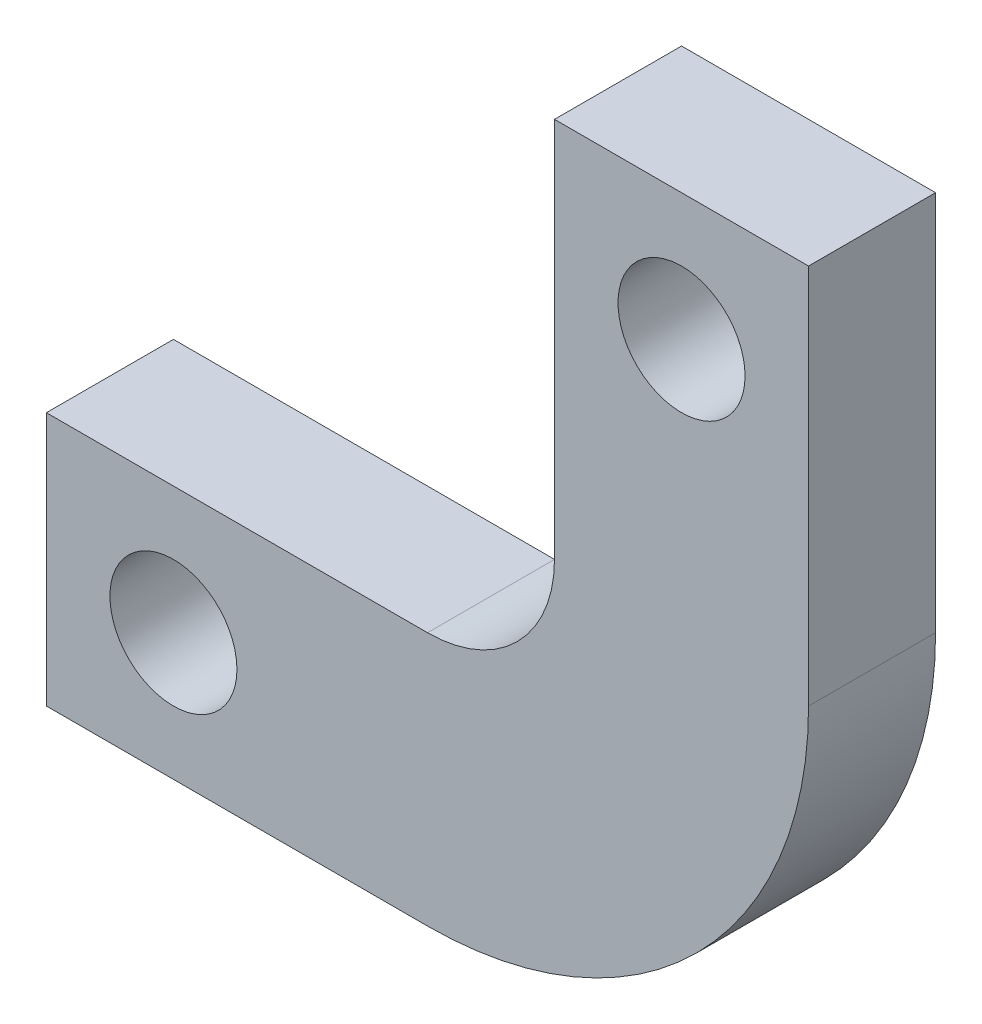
ISO-10303-21;
HEADER;
FILE_DESCRIPTION(('STEP AP214'),'2;1');
FILE_NAME('part.step','',(''),(''),'','','');
FILE_SCHEMA(('AUTOMOTIVE_DESIGN { 1 0 10303 214 1 1 1 1 }'));
ENDSEC;
DATA;
#1=APPLICATION_CONTEXT('core data for automotive mechanical design processes');
#2=APPLICATION_PROTOCOL_DEFINITION('international standard','automotive_design',2000,#1);
#3=PRODUCT_CONTEXT('',#1,'mechanical');
#4=PRODUCT('Part','Part','',(#3));
#5=PRODUCT_RELATED_PRODUCT_CATEGORY('part','',(#4));
#6=PRODUCT_DEFINITION_FORMATION('','',#4);
#7=PRODUCT_DEFINITION_CONTEXT('part definition',#1,'design');
#8=PRODUCT_DEFINITION('design','',#6,#7);
#9=PRODUCT_DEFINITION_SHAPE('','',#8);
#10=(LENGTH_UNIT() NAMED_UNIT(*) SI_UNIT(.MILLI.,.METRE.));
#11=(NAMED_UNIT(*) PLANE_ANGLE_UNIT() SI_UNIT($,.RADIAN.));
#12=(NAMED_UNIT(*) SI_UNIT($,.STERADIAN.) SOLID_ANGLE_UNIT());
#13=UNCERTAINTY_MEASURE_WITH_UNIT(LENGTH_MEASURE(1.E-05),#10,'distance_accuracy_value','');
#14=(GEOMETRIC_REPRESENTATION_CONTEXT(3) GLOBAL_UNCERTAINTY_ASSIGNED_CONTEXT((#13)) GLOBAL_UNIT_ASSIGNED_CONTEXT((#10,
#11,#12)) REPRESENTATION_CONTEXT('',''));
#15=CARTESIAN_POINT('',(0.,0.,0.));
#16=DIRECTION('',(0.,0.,1.));
#17=DIRECTION('',(1.,0.,0.));
#18=AXIS2_PLACEMENT_3D('',#15,#16,#17);
#19=CARTESIAN_POINT('',(18.,18.,3.));
#20=DIRECTION('',(0.,0.,1.));
#21=DIRECTION('',(1.,0.,0.));
#22=AXIS2_PLACEMENT_3D('',#19,#20,#21);
#23=PLANE('',#22);
#24=CARTESIAN_POINT('',(6.,6.,3.));
#25=DIRECTION('',(0.,0.,1.));
#26=DIRECTION('',(1.,0.,0.));
#27=AXIS2_PLACEMENT_3D('',#24,#25,#26);
#28=CIRCLE('',#27,3.);
#29=CARTESIAN_POINT('',(9.,6.,3.));
#30=VERTEX_POINT('',#29);
#31=EDGE_CURVE('E135',#30,#30,#28,.T.);
#32=ORIENTED_EDGE('',*,*,#31,.F.);
#33=EDGE_LOOP('',(#32));
#34=FACE_BOUND('',#33,.T.);
#35=DIRECTION('',(0.,-1.,0.));
#36=VECTOR('',#35,1.);
#37=CARTESIAN_POINT('',(0.,0.,3.));
#38=LINE('',#37,#36);
#39=CARTESIAN_POINT('',(0.,12.,3.));
#40=VERTEX_POINT('',#39);
#41=CARTESIAN_POINT('',(0.,0.,3.));
#42=VERTEX_POINT('',#41);
#43=EDGE_CURVE('E146',#40,#42,#38,.T.);
#44=ORIENTED_EDGE('',*,*,#43,.T.);
#45=DIRECTION('',(1.,0.,0.));
#46=VECTOR('',#45,1.);
#47=CARTESIAN_POINT('',(0.,0.,3.));
#48=LINE('',#47,#46);
#49=CARTESIAN_POINT('',(18.,0.,3.));
#50=VERTEX_POINT('',#49);
#51=EDGE_CURVE('E94',#42,#50,#48,.T.);
#52=ORIENTED_EDGE('',*,*,#51,.T.);
#53=CARTESIAN_POINT('',(18.,18.,3.));
#54=DIRECTION('',(0.,0.,1.));
#55=DIRECTION('',(1.,0.,0.));
#56=AXIS2_PLACEMENT_3D('',#53,#54,#55);
#57=CIRCLE('',#56,18.);
#58=CARTESIAN_POINT('',(36.,18.,3.));
#59=VERTEX_POINT('',#58);
#60=EDGE_CURVE('E161',#50,#59,#57,.T.);
#61=ORIENTED_EDGE('',*,*,#60,.T.);
#62=DIRECTION('',(0.,1.,0.));
#63=VECTOR('',#62,1.);
#64=CARTESIAN_POINT('',(36.,18.,3.));
#65=LINE('',#64,#63);
#66=CARTESIAN_POINT('',(36.,36.,3.));
#67=VERTEX_POINT('',#66);
#68=EDGE_CURVE('E174',#59,#67,#65,.T.);
#69=ORIENTED_EDGE('',*,*,#68,.T.);
#70=DIRECTION('',(-1.,0.,0.));
#71=VECTOR('',#70,1.);
#72=CARTESIAN_POINT('',(36.,36.,3.));
#73=LINE('',#72,#71);
#74=CARTESIAN_POINT('',(24.,36.,3.));
#75=VERTEX_POINT('',#74);
#76=EDGE_CURVE('E113',#67,#75,#73,.T.);
#77=ORIENTED_EDGE('',*,*,#76,.T.);
#78=DIRECTION('',(0.,-1.,0.));
#79=VECTOR('',#78,1.);
#80=CARTESIAN_POINT('',(24.,18.,3.));
#81=LINE('',#80,#79);
#82=CARTESIAN_POINT('',(24.,18.,3.));
#83=VERTEX_POINT('',#82);
#84=EDGE_CURVE('E107',#75,#83,#81,.T.);
#85=ORIENTED_EDGE('',*,*,#84,.T.);
#86=CARTESIAN_POINT('',(18.,18.,3.));
#87=DIRECTION('',(0.,0.,-1.));
#88=DIRECTION('',(1.,0.,0.));
#89=AXIS2_PLACEMENT_3D('',#86,#87,#88);
#90=CIRCLE('',#89,6.);
#91=CARTESIAN_POINT('',(18.,12.,3.));
#92=VERTEX_POINT('',#91);
#93=EDGE_CURVE('E111',#83,#92,#90,.T.);
#94=ORIENTED_EDGE('',*,*,#93,.T.);
#95=DIRECTION('',(-1.,0.,0.));
#96=VECTOR('',#95,1.);
#97=CARTESIAN_POINT('',(0.,12.,3.));
#98=LINE('',#97,#96);
#99=EDGE_CURVE('E51',#92,#40,#98,.T.);
#100=ORIENTED_EDGE('',*,*,#99,.T.);
#101=EDGE_LOOP('',(#44,#52,#61,#69,#77,#85,#94,#100));
#102=FACE_BOUND('',#101,.T.);
#103=CARTESIAN_POINT('',(30.,30.,3.));
#104=DIRECTION('',(0.,0.,1.));
#105=DIRECTION('',(1.,0.,0.));
#106=AXIS2_PLACEMENT_3D('',#103,#104,#105);
#107=CIRCLE('',#106,3.);
#108=CARTESIAN_POINT('',(33.,30.,3.));
#109=VERTEX_POINT('',#108);
#110=EDGE_CURVE('E183',#109,#109,#107,.T.);
#111=ORIENTED_EDGE('',*,*,#110,.F.);
#112=EDGE_LOOP('',(#111));
#113=FACE_BOUND('',#112,.T.);
#114=ADVANCED_FACE('F34',(#34,#102,#113),#23,.T.);
#115=CARTESIAN_POINT('',(18.,18.,-3.));
#116=DIRECTION('',(0.,0.,1.));
#117=DIRECTION('',(1.,0.,0.));
#118=AXIS2_PLACEMENT_3D('',#115,#116,#117);
#119=PLANE('',#118);
#120=DIRECTION('',(0.,-1.,0.));
#121=VECTOR('',#120,1.);
#122=CARTESIAN_POINT('',(0.,0.,-3.));
#123=LINE('',#122,#121);
#124=CARTESIAN_POINT('',(0.,12.,-3.));
#125=VERTEX_POINT('',#124);
#126=CARTESIAN_POINT('',(0.,0.,-3.));
#127=VERTEX_POINT('',#126);
#128=EDGE_CURVE('E131',#125,#127,#123,.T.);
#129=ORIENTED_EDGE('',*,*,#128,.F.);
#130=DIRECTION('',(-1.,0.,0.));
#131=VECTOR('',#130,1.);
#132=CARTESIAN_POINT('',(0.,12.,-3.));
#133=LINE('',#132,#131);
#134=CARTESIAN_POINT('',(18.,12.,-3.));
#135=VERTEX_POINT('',#134);
#136=EDGE_CURVE('E86',#135,#125,#133,.T.);
#137=ORIENTED_EDGE('',*,*,#136,.F.);
#138=CARTESIAN_POINT('',(18.,18.,-3.));
#139=DIRECTION('',(0.,0.,-1.));
#140=DIRECTION('',(1.,0.,0.));
#141=AXIS2_PLACEMENT_3D('',#138,#139,#140);
#142=CIRCLE('',#141,6.);
#143=CARTESIAN_POINT('',(24.,18.,-3.));
#144=VERTEX_POINT('',#143);
#145=EDGE_CURVE('E80',#144,#135,#142,.T.);
#146=ORIENTED_EDGE('',*,*,#145,.F.);
#147=DIRECTION('',(0.,-1.,0.));
#148=VECTOR('',#147,1.);
#149=CARTESIAN_POINT('',(24.,18.,-3.));
#150=LINE('',#149,#148);
#151=CARTESIAN_POINT('',(24.,36.,-3.));
#152=VERTEX_POINT('',#151);
#153=EDGE_CURVE('E121',#152,#144,#150,.T.);
#154=ORIENTED_EDGE('',*,*,#153,.F.);
#155=DIRECTION('',(-1.,0.,0.));
#156=VECTOR('',#155,1.);
#157=CARTESIAN_POINT('',(36.,36.,-3.));
#158=LINE('',#157,#156);
#159=CARTESIAN_POINT('',(36.,36.,-3.));
#160=VERTEX_POINT('',#159);
#161=EDGE_CURVE('E141',#160,#152,#158,.T.);
#162=ORIENTED_EDGE('',*,*,#161,.F.);
#163=DIRECTION('',(0.,1.,0.));
#164=VECTOR('',#163,1.);
#165=CARTESIAN_POINT('',(36.,18.,-3.));
#166=LINE('',#165,#164);
#167=CARTESIAN_POINT('',(36.,18.,-3.));
#168=VERTEX_POINT('',#167);
#169=EDGE_CURVE('E139',#168,#160,#166,.T.);
#170=ORIENTED_EDGE('',*,*,#169,.F.);
#171=CARTESIAN_POINT('',(18.,18.,-3.));
#172=DIRECTION('',(0.,0.,1.));
#173=DIRECTION('',(1.,0.,0.));
#174=AXIS2_PLACEMENT_3D('',#171,#172,#173);
#175=CIRCLE('',#174,18.);
#176=CARTESIAN_POINT('',(18.,0.,-3.));
#177=VERTEX_POINT('',#176);
#178=EDGE_CURVE('E137',#177,#168,#175,.T.);
#179=ORIENTED_EDGE('',*,*,#178,.F.);
#180=DIRECTION('',(1.,0.,0.));
#181=VECTOR('',#180,1.);
#182=CARTESIAN_POINT('',(0.,0.,-3.));
#183=LINE('',#182,#181);
#184=EDGE_CURVE('E134',#127,#177,#183,.T.);
#185=ORIENTED_EDGE('',*,*,#184,.F.);
#186=EDGE_LOOP('',(#129,#137,#146,#154,#162,#170,#179,#185));
#187=FACE_BOUND('',#186,.T.);
#188=CARTESIAN_POINT('',(6.,6.,-3.));
#189=DIRECTION('',(0.,0.,1.));
#190=DIRECTION('',(1.,0.,0.));
#191=AXIS2_PLACEMENT_3D('',#188,#189,#190);
#192=CIRCLE('',#191,3.);
#193=CARTESIAN_POINT('',(9.,6.,-3.));
#194=VERTEX_POINT('',#193);
#195=EDGE_CURVE('E180',#194,#194,#192,.T.);
#196=ORIENTED_EDGE('',*,*,#195,.T.);
#197=EDGE_LOOP('',(#196));
#198=FACE_BOUND('',#197,.T.);
#199=CARTESIAN_POINT('',(30.,30.,-3.));
#200=DIRECTION('',(0.,0.,1.));
#201=DIRECTION('',(1.,0.,0.));
#202=AXIS2_PLACEMENT_3D('',#199,#200,#201);
#203=CIRCLE('',#202,3.);
#204=CARTESIAN_POINT('',(33.,30.,-3.));
#205=VERTEX_POINT('',#204);
#206=EDGE_CURVE('E186',#205,#205,#203,.T.);
#207=ORIENTED_EDGE('',*,*,#206,.T.);
#208=EDGE_LOOP('',(#207));
#209=FACE_BOUND('',#208,.T.);
#210=ADVANCED_FACE('F165',(#187,#198,#209),#119,.F.);
#211=CARTESIAN_POINT('',(0.,0.,3.));
#212=DIRECTION('',(1.,0.,0.));
#213=DIRECTION('',(0.,0.,-1.));
#214=AXIS2_PLACEMENT_3D('',#211,#212,#213);
#215=PLANE('',#214);
#216=ORIENTED_EDGE('',*,*,#128,.T.);
#217=DIRECTION('',(0.,0.,-1.));
#218=VECTOR('',#217,1.);
#219=CARTESIAN_POINT('',(0.,0.,3.));
#220=LINE('',#219,#218);
#221=EDGE_CURVE('E11',#42,#127,#220,.T.);
#222=ORIENTED_EDGE('',*,*,#221,.F.);
#223=ORIENTED_EDGE('',*,*,#43,.F.);
#224=DIRECTION('',(0.,0.,-1.));
#225=VECTOR('',#224,1.);
#226=CARTESIAN_POINT('',(0.,12.,3.));
#227=LINE('',#226,#225);
#228=EDGE_CURVE('E127',#40,#125,#227,.T.);
#229=ORIENTED_EDGE('',*,*,#228,.T.);
#230=EDGE_LOOP('',(#216,#222,#223,#229));
#231=FACE_BOUND('',#230,.T.);
#232=ADVANCED_FACE('F36',(#231),#215,.F.);
#233=CARTESIAN_POINT('',(0.,0.,3.));
#234=DIRECTION('',(0.,1.,0.));
#235=DIRECTION('',(0.,0.,1.));
#236=AXIS2_PLACEMENT_3D('',#233,#234,#235);
#237=PLANE('',#236);
#238=ORIENTED_EDGE('',*,*,#184,.T.);
#239=DIRECTION('',(0.,0.,-1.));
#240=VECTOR('',#239,1.);
#241=CARTESIAN_POINT('',(18.,0.,3.));
#242=LINE('',#241,#240);
#243=EDGE_CURVE('E43',#50,#177,#242,.T.);
#244=ORIENTED_EDGE('',*,*,#243,.F.);
#245=ORIENTED_EDGE('',*,*,#51,.F.);
#246=ORIENTED_EDGE('',*,*,#221,.T.);
#247=EDGE_LOOP('',(#238,#244,#245,#246));
#248=FACE_BOUND('',#247,.T.);
#249=ADVANCED_FACE('F218',(#248),#237,.F.);
#250=CARTESIAN_POINT('',(18.,18.,3.));
#251=DIRECTION('',(0.,0.,-1.));
#252=DIRECTION('',(-1.,0.,0.));
#253=AXIS2_PLACEMENT_3D('',#250,#251,#252);
#254=CYLINDRICAL_SURFACE('',#253,18.);
#255=ORIENTED_EDGE('',*,*,#178,.T.);
#256=DIRECTION('',(0.,0.,-1.));
#257=VECTOR('',#256,1.);
#258=CARTESIAN_POINT('',(36.,18.,3.));
#259=LINE('',#258,#257);
#260=EDGE_CURVE('E153',#59,#168,#259,.T.);
#261=ORIENTED_EDGE('',*,*,#260,.F.);
#262=ORIENTED_EDGE('',*,*,#60,.F.);
#263=ORIENTED_EDGE('',*,*,#243,.T.);
#264=EDGE_LOOP('',(#255,#261,#262,#263));
#265=FACE_BOUND('',#264,.T.);
#266=ADVANCED_FACE('F159',(#265),#254,.T.);
#267=CARTESIAN_POINT('',(36.,18.,3.));
#268=DIRECTION('',(-1.,0.,0.));
#269=DIRECTION('',(0.,-1.,0.));
#270=AXIS2_PLACEMENT_3D('',#267,#268,#269);
#271=PLANE('',#270);
#272=ORIENTED_EDGE('',*,*,#169,.T.);
#273=DIRECTION('',(0.,0.,-1.));
#274=VECTOR('',#273,1.);
#275=CARTESIAN_POINT('',(36.,36.,3.));
#276=LINE('',#275,#274);
#277=EDGE_CURVE('E150',#67,#160,#276,.T.);
#278=ORIENTED_EDGE('',*,*,#277,.F.);
#279=ORIENTED_EDGE('',*,*,#68,.F.);
#280=ORIENTED_EDGE('',*,*,#260,.T.);
#281=EDGE_LOOP('',(#272,#278,#279,#280));
#282=FACE_BOUND('',#281,.T.);
#283=ADVANCED_FACE('F170',(#282),#271,.F.);
#284=CARTESIAN_POINT('',(36.,36.,3.));
#285=DIRECTION('',(0.,-1.,0.));
#286=DIRECTION('',(0.,0.,-1.));
#287=AXIS2_PLACEMENT_3D('',#284,#285,#286);
#288=PLANE('',#287);
#289=ORIENTED_EDGE('',*,*,#161,.T.);
#290=DIRECTION('',(0.,0.,-1.));
#291=VECTOR('',#290,1.);
#292=CARTESIAN_POINT('',(24.,36.,3.));
#293=LINE('',#292,#291);
#294=EDGE_CURVE('E122',#75,#152,#293,.T.);
#295=ORIENTED_EDGE('',*,*,#294,.F.);
#296=ORIENTED_EDGE('',*,*,#76,.F.);
#297=ORIENTED_EDGE('',*,*,#277,.T.);
#298=EDGE_LOOP('',(#289,#295,#296,#297));
#299=FACE_BOUND('',#298,.T.);
#300=ADVANCED_FACE('F173',(#299),#288,.F.);
#301=CARTESIAN_POINT('',(24.,18.,3.));
#302=DIRECTION('',(1.,0.,0.));
#303=DIRECTION('',(0.,0.,-1.));
#304=AXIS2_PLACEMENT_3D('',#301,#302,#303);
#305=PLANE('',#304);
#306=ORIENTED_EDGE('',*,*,#153,.T.);
#307=DIRECTION('',(0.,0.,-1.));
#308=VECTOR('',#307,1.);
#309=CARTESIAN_POINT('',(24.,18.,3.));
#310=LINE('',#309,#308);
#311=EDGE_CURVE('E118',#83,#144,#310,.T.);
#312=ORIENTED_EDGE('',*,*,#311,.F.);
#313=ORIENTED_EDGE('',*,*,#84,.F.);
#314=ORIENTED_EDGE('',*,*,#294,.T.);
#315=EDGE_LOOP('',(#306,#312,#313,#314));
#316=FACE_BOUND('',#315,.T.);
#317=ADVANCED_FACE('F119',(#316),#305,.F.);
#318=CARTESIAN_POINT('',(18.,18.,3.));
#319=DIRECTION('',(0.,0.,-1.));
#320=DIRECTION('',(-1.,0.,0.));
#321=AXIS2_PLACEMENT_3D('',#318,#319,#320);
#322=CYLINDRICAL_SURFACE('',#321,6.);
#323=ORIENTED_EDGE('',*,*,#145,.T.);
#324=DIRECTION('',(0.,0.,-1.));
#325=VECTOR('',#324,1.);
#326=CARTESIAN_POINT('',(18.,12.,3.));
#327=LINE('',#326,#325);
#328=EDGE_CURVE('E123',#92,#135,#327,.T.);
#329=ORIENTED_EDGE('',*,*,#328,.F.);
#330=ORIENTED_EDGE('',*,*,#93,.F.);
#331=ORIENTED_EDGE('',*,*,#311,.T.);
#332=EDGE_LOOP('',(#323,#329,#330,#331));
#333=FACE_BOUND('',#332,.T.);
#334=ADVANCED_FACE('F125',(#333),#322,.F.);
#335=CARTESIAN_POINT('',(0.,12.,3.));
#336=DIRECTION('',(0.,-1.,0.));
#337=DIRECTION('',(0.,0.,-1.));
#338=AXIS2_PLACEMENT_3D('',#335,#336,#337);
#339=PLANE('',#338);
#340=ORIENTED_EDGE('',*,*,#136,.T.);
#341=ORIENTED_EDGE('',*,*,#228,.F.);
#342=ORIENTED_EDGE('',*,*,#99,.F.);
#343=ORIENTED_EDGE('',*,*,#328,.T.);
#344=EDGE_LOOP('',(#340,#341,#342,#343));
#345=FACE_BOUND('',#344,.T.);
#346=ADVANCED_FACE('F206',(#345),#339,.F.);
#347=CARTESIAN_POINT('',(6.,6.,3.));
#348=DIRECTION('',(0.,0.,-1.));
#349=DIRECTION('',(-1.,0.,0.));
#350=AXIS2_PLACEMENT_3D('',#347,#348,#349);
#351=CYLINDRICAL_SURFACE('',#350,3.);
#352=ORIENTED_EDGE('',*,*,#31,.T.);
#353=EDGE_LOOP('',(#352));
#354=FACE_BOUND('',#353,.T.);
#355=ORIENTED_EDGE('',*,*,#195,.F.);
#356=EDGE_LOOP('',(#355));
#357=FACE_BOUND('',#356,.T.);
#358=ADVANCED_FACE('F203',(#354,#357),#351,.F.);
#359=CARTESIAN_POINT('',(30.,30.,3.));
#360=DIRECTION('',(0.,0.,-1.));
#361=DIRECTION('',(-1.,0.,0.));
#362=AXIS2_PLACEMENT_3D('',#359,#360,#361);
#363=CYLINDRICAL_SURFACE('',#362,3.);
#364=ORIENTED_EDGE('',*,*,#110,.T.);
#365=EDGE_LOOP('',(#364));
#366=FACE_BOUND('',#365,.T.);
#367=ORIENTED_EDGE('',*,*,#206,.F.);
#368=EDGE_LOOP('',(#367));
#369=FACE_BOUND('',#368,.T.);
#370=ADVANCED_FACE('F192',(#366,#369),#363,.F.);
#371=CLOSED_SHELL('',(#114,#210,#232,#249,#266,#283,#300,#317,#334,#346,#358,#370));
#372=MANIFOLD_SOLID_BREP('B2',#371);
#373=ADVANCED_BREP_SHAPE_REPRESENTATION('',(#18,#372),#14);
#374=SHAPE_DEFINITION_REPRESENTATION(#9,#373);
ENDSEC;
END-ISO-10303-21;
